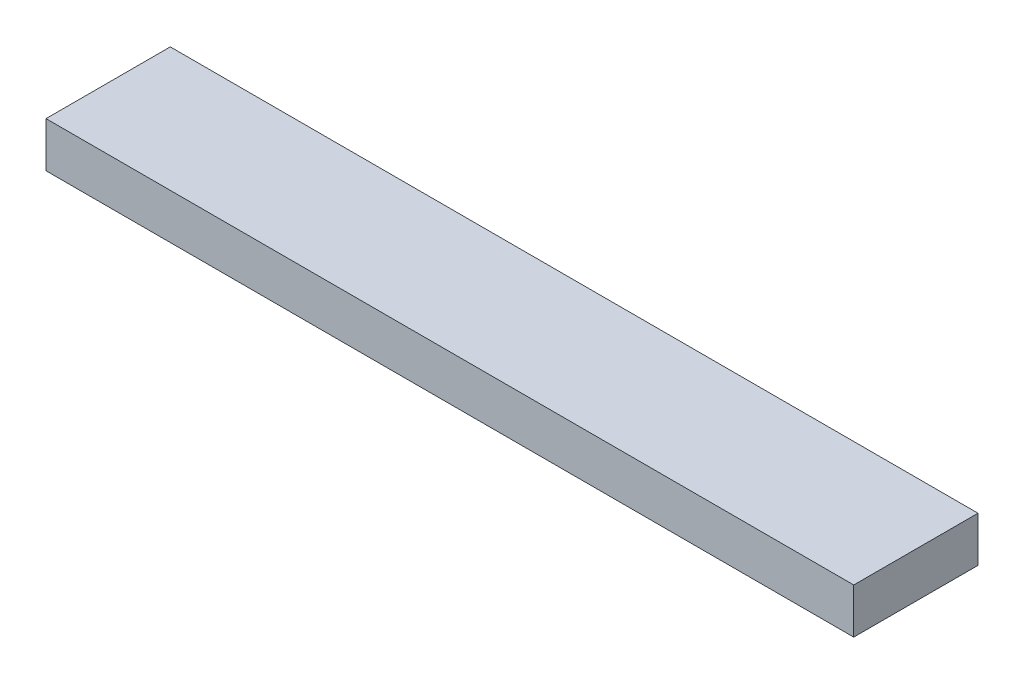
from build123d import *

# Parameters (mm, degrees)
SKETCH1_W           = 69.85
SKETCH1_H           = 25.4
BOSS_EXTRUDE1_DEPTH = 227.0125


with BuildPart() as part:
    # Sketch1 → Boss-Extrude1 (new, symmetric)
    with BuildSketch(Plane(origin=(0, 0, 0), x_dir=(0, 0, -1), z_dir=(1, 0, 0))):
        Rectangle(SKETCH1_W, SKETCH1_H)
    extrude(amount=BOSS_EXTRUDE1_DEPTH, both=True)


solid = part.part
